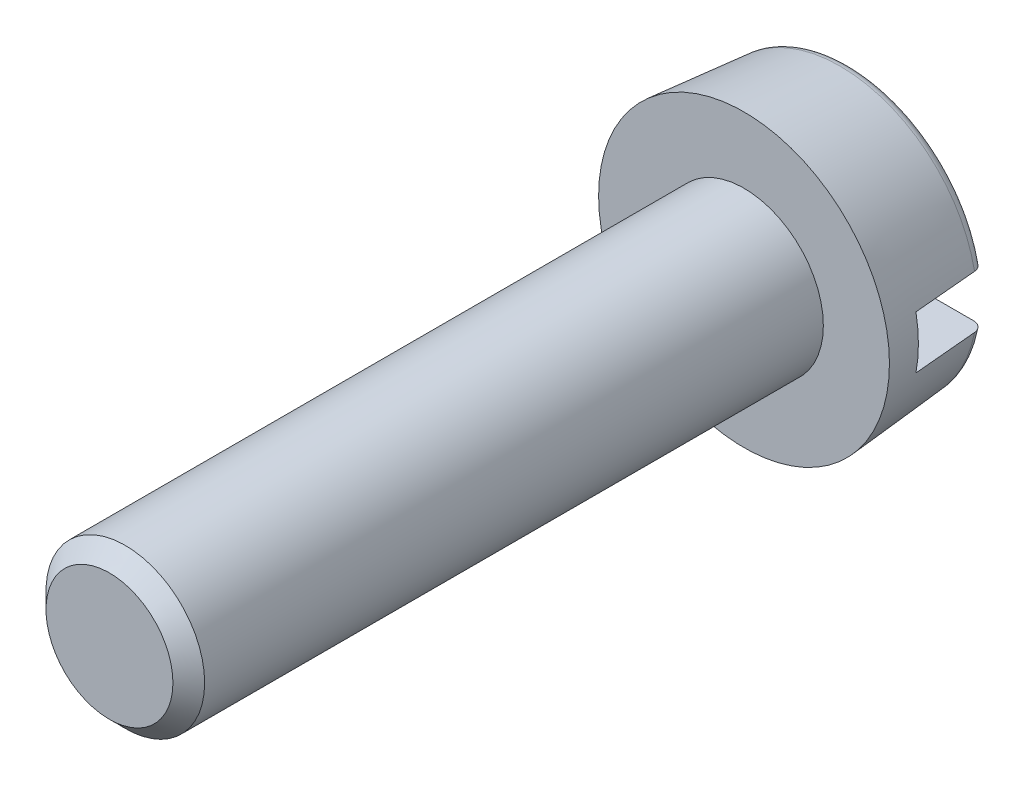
ISO-10303-21;
HEADER;
FILE_DESCRIPTION(('STEP AP214'),'2;1');
FILE_NAME('part.step','',(''),(''),'','','');
FILE_SCHEMA(('AUTOMOTIVE_DESIGN { 1 0 10303 214 1 1 1 1 }'));
ENDSEC;
DATA;
#1=APPLICATION_CONTEXT('core data for automotive mechanical design processes');
#2=APPLICATION_PROTOCOL_DEFINITION('international standard','automotive_design',2000,#1);
#3=PRODUCT_CONTEXT('',#1,'mechanical');
#4=PRODUCT('Part','Part','',(#3));
#5=PRODUCT_RELATED_PRODUCT_CATEGORY('part','',(#4));
#6=PRODUCT_DEFINITION_FORMATION('','',#4);
#7=PRODUCT_DEFINITION_CONTEXT('part definition',#1,'design');
#8=PRODUCT_DEFINITION('design','',#6,#7);
#9=PRODUCT_DEFINITION_SHAPE('','',#8);
#10=(LENGTH_UNIT() NAMED_UNIT(*) SI_UNIT(.MILLI.,.METRE.));
#11=(NAMED_UNIT(*) PLANE_ANGLE_UNIT() SI_UNIT($,.RADIAN.));
#12=(NAMED_UNIT(*) SI_UNIT($,.STERADIAN.) SOLID_ANGLE_UNIT());
#13=UNCERTAINTY_MEASURE_WITH_UNIT(LENGTH_MEASURE(1.E-05),#10,'distance_accuracy_value','');
#14=(GEOMETRIC_REPRESENTATION_CONTEXT(3) GLOBAL_UNCERTAINTY_ASSIGNED_CONTEXT((#13)) GLOBAL_UNIT_ASSIGNED_CONTEXT((#10,
#11,#12)) REPRESENTATION_CONTEXT('',''));
#15=CARTESIAN_POINT('',(0.,0.,0.));
#16=DIRECTION('',(0.,0.,1.));
#17=DIRECTION('',(1.,0.,0.));
#18=AXIS2_PLACEMENT_3D('',#15,#16,#17);
#19=CARTESIAN_POINT('',(0.,0.,-2.));
#20=DIRECTION('',(0.,0.,1.));
#21=DIRECTION('',(1.,0.,0.));
#22=AXIS2_PLACEMENT_3D('',#19,#20,#21);
#23=PLANE('',#22);
#24=DIRECTION('',(1.,0.,0.));
#25=VECTOR('',#24,1.);
#26=CARTESIAN_POINT('',(-2.75,-0.5,-2.));
#27=LINE('',#26,#25);
#28=CARTESIAN_POINT('',(-2.33890975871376,-0.5,-2.));
#29=VERTEX_POINT('',#28);
#30=CARTESIAN_POINT('',(2.33890975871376,-0.5,-2.));
#31=VERTEX_POINT('',#30);
#32=EDGE_CURVE('E197',#29,#31,#27,.T.);
#33=ORIENTED_EDGE('',*,*,#32,.T.);
#34=CARTESIAN_POINT('',(0.,0.,-2.));
#35=DIRECTION('',(0.,0.,-1.));
#36=DIRECTION('',(-1.,0.,0.));
#37=AXIS2_PLACEMENT_3D('',#34,#35,#36);
#38=CIRCLE('',#37,2.39175643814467);
#39=EDGE_CURVE('E107',#31,#29,#38,.T.);
#40=ORIENTED_EDGE('',*,*,#39,.T.);
#41=EDGE_LOOP('',(#33,#40));
#42=FACE_BOUND('',#41,.T.);
#43=ADVANCED_FACE('F27',(#42),#23,.F.);
#44=DIRECTION('',(-1.,0.,0.));
#45=VECTOR('',#44,1.);
#46=CARTESIAN_POINT('',(-2.75,0.5,-2.));
#47=LINE('',#46,#45);
#48=CARTESIAN_POINT('',(2.33890975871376,0.5,-2.));
#49=VERTEX_POINT('',#48);
#50=CARTESIAN_POINT('',(-2.33890975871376,0.5,-2.));
#51=VERTEX_POINT('',#50);
#52=EDGE_CURVE('E92',#49,#51,#47,.T.);
#53=ORIENTED_EDGE('',*,*,#52,.T.);
#54=EDGE_CURVE('E104',#51,#49,#38,.T.);
#55=ORIENTED_EDGE('',*,*,#54,.T.);
#56=EDGE_LOOP('',(#53,#55));
#57=FACE_BOUND('',#56,.T.);
#58=ADVANCED_FACE('F138',(#57),#23,.F.);
#59=CARTESIAN_POINT('',(0.,0.,-1.8));
#60=DIRECTION('',(0.,0.,-1.));
#61=DIRECTION('',(-1.,0.,0.));
#62=AXIS2_PLACEMENT_3D('',#59,#60,#61);
#63=TOROIDAL_SURFACE('',#62,2.39175643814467,0.2);
#64=CARTESIAN_POINT('',(-2.43472133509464,-0.5,-1.62334724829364));
#65=CARTESIAN_POINT('',(-2.44481857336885,-0.5,-1.62858686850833));
#66=CARTESIAN_POINT('',(-2.45447179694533,-0.5,-1.63468201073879));
#67=CARTESIAN_POINT('',(-2.47263104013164,-0.5,-1.64839238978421));
#68=CARTESIAN_POINT('',(-2.48113701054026,-0.5,-1.65600769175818));
#69=CARTESIAN_POINT('',(-2.49674910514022,-0.5,-1.67257485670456));
#70=CARTESIAN_POINT('',(-2.50385388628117,-0.5,-1.68152798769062));
#71=CARTESIAN_POINT('',(-2.51643111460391,-0.5,-1.70051023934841));
#72=CARTESIAN_POINT('',(-2.52190434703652,-0.5,-1.71053883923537));
#73=CARTESIAN_POINT('',(-2.5309838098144,-0.5,-1.73124202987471));
#74=CARTESIAN_POINT('',(-2.53461496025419,-0.5,-1.74190568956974));
#75=CARTESIAN_POINT('',(-2.54000899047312,-0.5,-1.76369811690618));
#76=CARTESIAN_POINT('',(-2.54177157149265,-0.5,-1.77482695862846));
#77=CARTESIAN_POINT('',(-2.54335981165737,-0.5,-1.79707198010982));
#78=CARTESIAN_POINT('',(-2.5432110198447,-0.5,-1.80818634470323));
#79=CARTESIAN_POINT('',(-2.54104324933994,-0.5,-1.83022860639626));
#80=CARTESIAN_POINT('',(-2.53902478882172,-0.5,-1.84115655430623));
#81=CARTESIAN_POINT('',(-2.53333925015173,-0.5,-1.86194423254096));
#82=CARTESIAN_POINT('',(-2.5297662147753,-0.5,-1.87182983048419));
#83=CARTESIAN_POINT('',(-2.52110242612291,-0.5,-1.89091215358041));
#84=CARTESIAN_POINT('',(-2.51601152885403,-0.5,-1.90010881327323));
#85=CARTESIAN_POINT('',(-2.50395114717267,-0.5,-1.91834043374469));
#86=CARTESIAN_POINT('',(-2.49685795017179,-0.5,-1.92729380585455));
#87=CARTESIAN_POINT('',(-2.48126160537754,-0.5,-1.94387567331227));
#88=CARTESIAN_POINT('',(-2.47275808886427,-0.5,-1.95150382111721));
#89=CARTESIAN_POINT('',(-2.45460452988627,-0.5,-1.96522557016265));
#90=CARTESIAN_POINT('',(-2.44495548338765,-0.5,-1.97132049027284));
#91=CARTESIAN_POINT('',(-2.42478363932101,-0.5,-1.98183070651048));
#92=CARTESIAN_POINT('',(-2.41426084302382,-0.5,-1.9862460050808));
#93=CARTESIAN_POINT('',(-2.39247627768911,-0.5,-1.99334317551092));
#94=CARTESIAN_POINT('',(-2.38120597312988,-0.5,-1.99599884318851));
#95=CARTESIAN_POINT('',(-2.35838126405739,-0.5,-1.99941158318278));
#96=CARTESIAN_POINT('',(-2.34682683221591,-0.5,-2.00016847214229));
#97=CARTESIAN_POINT('',(-2.32357645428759,-0.5,-1.9997658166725));
#98=CARTESIAN_POINT('',(-2.31188100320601,-0.5,-1.99857718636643));
#99=CARTESIAN_POINT('',(-2.28885296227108,-0.5,-1.99426077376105));
#100=CARTESIAN_POINT('',(-2.2775203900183,-0.5,-1.99113289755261));
#101=CARTESIAN_POINT('',(-2.25550391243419,-0.5,-1.98300415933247));
#102=CARTESIAN_POINT('',(-2.24482231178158,-0.5,-1.97799704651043));
#103=CARTESIAN_POINT('',(-2.22446468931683,-0.5,-1.96624009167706));
#104=CARTESIAN_POINT('',(-2.21478862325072,-0.5,-1.95949032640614));
#105=CARTESIAN_POINT('',(-2.19684690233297,-0.5,-1.94451734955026));
#106=CARTESIAN_POINT('',(-2.18856586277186,-0.5,-1.93631258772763));
#107=CARTESIAN_POINT('',(-2.17353872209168,-0.5,-1.91860007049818));
#108=CARTESIAN_POINT('',(-2.16679242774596,-0.5,-1.90909247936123));
#109=CARTESIAN_POINT('',(-2.1551967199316,-0.5,-1.88928064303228));
#110=CARTESIAN_POINT('',(-2.15030674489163,-0.5,-1.87900014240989));
#111=CARTESIAN_POINT('',(-2.14236971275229,-0.5,-1.85775104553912));
#112=CARTESIAN_POINT('',(-2.13932233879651,-0.5,-1.84678256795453));
#113=CARTESIAN_POINT('',(-2.13522430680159,-0.5,-1.82474520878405));
#114=CARTESIAN_POINT('',(-2.1341285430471,-0.5,-1.81368469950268));
#115=CARTESIAN_POINT('',(-2.13383163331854,-0.5,-1.79153798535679));
#116=CARTESIAN_POINT('',(-2.1346304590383,-0.5,-1.78045178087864));
#117=CARTESIAN_POINT('',(-2.13807707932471,-0.5,-1.75869214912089));
#118=CARTESIAN_POINT('',(-2.14070518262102,-0.5,-1.74801559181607));
#119=CARTESIAN_POINT('',(-2.14770254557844,-0.5,-1.72725205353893));
#120=CARTESIAN_POINT('',(-2.15207151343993,-0.5,-1.71716497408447));
#121=CARTESIAN_POINT('',(-2.16245261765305,-0.5,-1.69777618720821));
#122=CARTESIAN_POINT('',(-2.16847711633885,-0.5,-1.68848110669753));
#123=CARTESIAN_POINT('',(-2.181972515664,-0.5,-1.6710022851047));
#124=CARTESIAN_POINT('',(-2.189444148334,-0.5,-1.66281911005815));
#125=CARTESIAN_POINT('',(-2.20579015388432,-0.5,-1.64761347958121));
#126=CARTESIAN_POINT('',(-2.21469123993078,-0.5,-1.64061977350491));
#127=CARTESIAN_POINT('',(-2.23351361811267,-0.5,-1.62817840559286));
#128=CARTESIAN_POINT('',(-2.24343476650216,-0.5,-1.62273052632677));
#129=CARTESIAN_POINT('',(-2.25373622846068,-0.5,-1.61813756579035));
#130=B_SPLINE_CURVE_WITH_KNOTS('',3,(#64,#65,#66,#67,#68,#69,#70,#71,#72,#73,#74,#75,#76,#77,
#78,#79,#80,#81,#82,#83,#84,#85,#86,#87,#88,#89,#90,#91,#92,#93,#94,#95,#96,#97,#98,#99,#100,
#101,#102,#103,#104,#105,#106,#107,#108,#109,#110,#111,#112,#113,#114,#115,#116,#117,#118,#119,
#120,#121,#122,#123,#124,#125,#126,#127,#128,#129),.UNSPECIFIED.,.F.,.F.,(4,2,2,2,2,2,2,2,2,2,2,
2,2,2,2,2,2,2,2,2,2,2,2,2,2,2,2,2,2,2,2,2,4),(0.,0.0340885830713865,0.0681786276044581,
0.102301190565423,0.136407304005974,0.170038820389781,0.203675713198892,0.23686345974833,
0.270042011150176,0.301444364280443,0.332849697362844,0.366949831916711,0.40105889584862,
0.435138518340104,0.469218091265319,0.503794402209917,0.538374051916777,0.573475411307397,
0.60857847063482,0.643799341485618,0.679018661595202,0.713819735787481,0.748616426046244,
0.782601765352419,0.816581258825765,0.849764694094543,0.88294763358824,0.91577879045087,
0.948604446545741,0.981682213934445,1.01477675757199,1.04858307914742,1.08238464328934),.UNSPECIFIED.);
#131=CARTESIAN_POINT('',(-2.54229365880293,-0.5,-1.81743114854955));
#132=VERTEX_POINT('',#131);
#133=EDGE_CURVE('E49',#29,#132,#130,.F.);
#134=ORIENTED_EDGE('',*,*,#133,.F.);
#135=ORIENTED_EDGE('',*,*,#39,.F.);
#136=CARTESIAN_POINT('',(2.23155278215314,-0.5,-1.62970236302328));
#137=CARTESIAN_POINT('',(2.2217884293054,-0.5,-1.63555933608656));
#138=CARTESIAN_POINT('',(2.21251766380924,-0.5,-1.64224071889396));
#139=CARTESIAN_POINT('',(2.19521090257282,-0.5,-1.65705158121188));
#140=CARTESIAN_POINT('',(2.18717530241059,-0.5,-1.66518152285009));
#141=CARTESIAN_POINT('',(2.17258522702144,-0.5,-1.68269414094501));
#142=CARTESIAN_POINT('',(2.16603234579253,-0.5,-1.69207814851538));
#143=CARTESIAN_POINT('',(2.15463268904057,-0.5,-1.71182494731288));
#144=CARTESIAN_POINT('',(2.14978492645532,-0.5,-1.72218716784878));
#145=CARTESIAN_POINT('',(2.14202621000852,-0.5,-1.74340062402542));
#146=CARTESIAN_POINT('',(2.13908179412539,-0.5,-1.75423961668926));
#147=CARTESIAN_POINT('',(2.1350912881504,-0.5,-1.77626420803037));
#148=CARTESIAN_POINT('',(2.1340454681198,-0.5,-1.78744985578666));
#149=CARTESIAN_POINT('',(2.13389057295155,-0.5,-1.80963158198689));
#150=CARTESIAN_POINT('',(2.13474687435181,-0.5,-1.82062743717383));
#151=CARTESIAN_POINT('',(2.13829641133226,-0.5,-1.84231561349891));
#152=CARTESIAN_POINT('',(2.14098911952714,-0.5,-1.85300802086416));
#153=CARTESIAN_POINT('',(2.1479196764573,-0.5,-1.87320297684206));
#154=CARTESIAN_POINT('',(2.15206162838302,-0.5,-1.88273861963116));
#155=CARTESIAN_POINT('',(2.16178326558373,-0.5,-1.90104667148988));
#156=CARTESIAN_POINT('',(2.16736315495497,-0.5,-1.90981897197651));
#157=CARTESIAN_POINT('',(2.18048605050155,-0.5,-1.9272950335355));
#158=CARTESIAN_POINT('',(2.18817611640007,-0.5,-1.93588874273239));
#159=CARTESIAN_POINT('',(2.20489721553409,-0.5,-1.95165582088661));
#160=CARTESIAN_POINT('',(2.21392869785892,-0.5,-1.95882871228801));
#161=CARTESIAN_POINT('',(2.2330514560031,-0.5,-1.97156079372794));
#162=CARTESIAN_POINT('',(2.24314168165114,-0.5,-1.97712156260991));
#163=CARTESIAN_POINT('',(2.26410058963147,-0.5,-1.9865003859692));
#164=CARTESIAN_POINT('',(2.27496925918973,-0.5,-1.99031846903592));
#165=CARTESIAN_POINT('',(2.29736007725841,-0.5,-1.99616425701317));
#166=CARTESIAN_POINT('',(2.30888979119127,-0.5,-1.99816300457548));
#167=CARTESIAN_POINT('',(2.33212162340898,-0.5,-2.00021473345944));
#168=CARTESIAN_POINT('',(2.34382375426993,-0.5,-2.0002675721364));
#169=CARTESIAN_POINT('',(2.36717206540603,-0.5,-1.99841415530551));
#170=CARTESIAN_POINT('',(2.37881694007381,-0.5,-1.99649136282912));
#171=CARTESIAN_POINT('',(2.40161490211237,-0.5,-1.99070549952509));
#172=CARTESIAN_POINT('',(2.41276799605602,-0.5,-1.98684245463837));
#173=CARTESIAN_POINT('',(2.43418423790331,-0.5,-1.97730378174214));
#174=CARTESIAN_POINT('',(2.44445268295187,-0.5,-1.97164005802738));
#175=CARTESIAN_POINT('',(2.46387087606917,-0.5,-1.95864065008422));
#176=CARTESIAN_POINT('',(2.47302072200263,-0.5,-1.95130511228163));
#177=CARTESIAN_POINT('',(2.48977261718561,-0.5,-1.93530184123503));
#178=CARTESIAN_POINT('',(2.49739839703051,-0.5,-1.92665895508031));
#179=CARTESIAN_POINT('',(2.51105556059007,-0.5,-1.90819355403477));
#180=CARTESIAN_POINT('',(2.51708711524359,-0.5,-1.89837116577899));
#181=CARTESIAN_POINT('',(2.52726025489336,-0.5,-1.87803442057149));
#182=CARTESIAN_POINT('',(2.53143676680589,-0.5,-1.86753753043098));
#183=CARTESIAN_POINT('',(2.53793838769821,-0.5,-1.84598555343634));
#184=CARTESIAN_POINT('',(2.54026370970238,-0.5,-1.83493053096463));
#185=CARTESIAN_POINT('',(2.54296829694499,-0.5,-1.81275021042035));
#186=CARTESIAN_POINT('',(2.54337563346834,-0.5,-1.80162832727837));
#187=CARTESIAN_POINT('',(2.54230779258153,-0.5,-1.77947486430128));
#188=CARTESIAN_POINT('',(2.54083256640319,-0.5,-1.768443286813));
#189=CARTESIAN_POINT('',(2.53605690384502,-0.5,-1.74683543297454));
#190=CARTESIAN_POINT('',(2.53276473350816,-0.5,-1.73625732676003));
#191=CARTESIAN_POINT('',(2.52446348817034,-0.5,-1.71580054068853));
#192=CARTESIAN_POINT('',(2.51945470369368,-0.5,-1.70592174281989));
#193=CARTESIAN_POINT('',(2.50783233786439,-0.5,-1.68706715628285));
#194=CARTESIAN_POINT('',(2.50120821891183,-0.5,-1.67809786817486));
#195=CARTESIAN_POINT('',(2.48656743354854,-0.5,-1.66137293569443));
#196=CARTESIAN_POINT('',(2.47855014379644,-0.5,-1.65361783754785));
#197=CARTESIAN_POINT('',(2.46121952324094,-0.5,-1.63941570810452));
#198=CARTESIAN_POINT('',(2.45188783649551,-0.5,-1.63299110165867));
#199=CARTESIAN_POINT('',(2.43229769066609,-0.5,-1.62175703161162));
#200=CARTESIAN_POINT('',(2.42203919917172,-0.5,-1.61694762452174));
#201=CARTESIAN_POINT('',(2.41145320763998,-0.5,-1.61302190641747));
#202=B_SPLINE_CURVE_WITH_KNOTS('',3,(#136,#137,#138,#139,#140,#141,#142,#143,#144,#145,#146,
#147,#148,#149,#150,#151,#152,#153,#154,#155,#156,#157,#158,#159,#160,#161,#162,#163,#164,#165,
#166,#167,#168,#169,#170,#171,#172,#173,#174,#175,#176,#177,#178,#179,#180,#181,#182,#183,#184,
#185,#186,#187,#188,#189,#190,#191,#192,#193,#194,#195,#196,#197,#198,#199,#200,#201),
.UNSPECIFIED.,.F.,.F.,(4,2,2,2,2,2,2,2,2,2,2,2,2,2,2,2,2,2,2,2,2,2,2,2,2,2,2,2,2,2,2,2,4),(0.,
0.0341216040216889,0.0682541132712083,0.102423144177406,0.13657236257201,0.170103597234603,
0.203639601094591,0.236570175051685,0.269491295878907,0.30055236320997,0.331617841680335,
0.366043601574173,0.400480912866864,0.434884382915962,0.469287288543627,0.504228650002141,
0.539172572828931,0.574411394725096,0.609649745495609,0.644659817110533,0.679666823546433,
0.71407694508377,0.748483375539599,0.782211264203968,0.815935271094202,0.849164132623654,
0.882393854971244,0.915473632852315,0.948547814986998,0.981843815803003,1.01515475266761,
1.04898816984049,1.08282277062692),.UNSPECIFIED.);
#203=CARTESIAN_POINT('',(2.54229365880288,-0.5,-1.81743114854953));
#204=VERTEX_POINT('',#203);
#205=EDGE_CURVE('E125',#204,#31,#202,.F.);
#206=ORIENTED_EDGE('',*,*,#205,.F.);
#207=CARTESIAN_POINT('',(0.,0.,-1.81743114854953));
#208=DIRECTION('',(0.,0.,-1.));
#209=DIRECTION('',(-1.,0.,0.));
#210=AXIS2_PLACEMENT_3D('',#207,#208,#209);
#211=CIRCLE('',#210,2.59099537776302);
#212=EDGE_CURVE('E116',#204,#132,#211,.T.);
#213=ORIENTED_EDGE('',*,*,#212,.T.);
#214=EDGE_LOOP('',(#134,#135,#206,#213));
#215=FACE_BOUND('',#214,.T.);
#216=ADVANCED_FACE('F133',(#215),#63,.T.);
#217=CARTESIAN_POINT('',(-2.43472133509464,0.5,-1.62334724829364));
#218=CARTESIAN_POINT('',(-2.44481857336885,0.5,-1.62858686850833));
#219=CARTESIAN_POINT('',(-2.45447179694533,0.5,-1.63468201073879));
#220=CARTESIAN_POINT('',(-2.47263104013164,0.5,-1.64839238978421));
#221=CARTESIAN_POINT('',(-2.48113701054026,0.5,-1.65600769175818));
#222=CARTESIAN_POINT('',(-2.49674910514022,0.5,-1.67257485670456));
#223=CARTESIAN_POINT('',(-2.50385388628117,0.5,-1.68152798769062));
#224=CARTESIAN_POINT('',(-2.51643111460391,0.5,-1.70051023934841));
#225=CARTESIAN_POINT('',(-2.52190434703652,0.5,-1.71053883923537));
#226=CARTESIAN_POINT('',(-2.5309838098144,0.5,-1.73124202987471));
#227=CARTESIAN_POINT('',(-2.53461496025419,0.5,-1.74190568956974));
#228=CARTESIAN_POINT('',(-2.54000899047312,0.5,-1.76369811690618));
#229=CARTESIAN_POINT('',(-2.54177157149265,0.5,-1.77482695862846));
#230=CARTESIAN_POINT('',(-2.54335981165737,0.5,-1.79707198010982));
#231=CARTESIAN_POINT('',(-2.5432110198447,0.5,-1.80818634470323));
#232=CARTESIAN_POINT('',(-2.54104324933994,0.5,-1.83022860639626));
#233=CARTESIAN_POINT('',(-2.53902478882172,0.5,-1.84115655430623));
#234=CARTESIAN_POINT('',(-2.53333925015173,0.5,-1.86194423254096));
#235=CARTESIAN_POINT('',(-2.5297662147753,0.5,-1.87182983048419));
#236=CARTESIAN_POINT('',(-2.52110242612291,0.5,-1.89091215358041));
#237=CARTESIAN_POINT('',(-2.51601152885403,0.5,-1.90010881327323));
#238=CARTESIAN_POINT('',(-2.50395114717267,0.5,-1.91834043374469));
#239=CARTESIAN_POINT('',(-2.49685795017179,0.5,-1.92729380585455));
#240=CARTESIAN_POINT('',(-2.48126160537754,0.5,-1.94387567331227));
#241=CARTESIAN_POINT('',(-2.47275808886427,0.5,-1.95150382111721));
#242=CARTESIAN_POINT('',(-2.45460452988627,0.5,-1.96522557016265));
#243=CARTESIAN_POINT('',(-2.44495548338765,0.5,-1.97132049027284));
#244=CARTESIAN_POINT('',(-2.42478363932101,0.5,-1.98183070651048));
#245=CARTESIAN_POINT('',(-2.41426084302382,0.5,-1.9862460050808));
#246=CARTESIAN_POINT('',(-2.39247627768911,0.5,-1.99334317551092));
#247=CARTESIAN_POINT('',(-2.38120597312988,0.5,-1.99599884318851));
#248=CARTESIAN_POINT('',(-2.35838126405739,0.5,-1.99941158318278));
#249=CARTESIAN_POINT('',(-2.34682683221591,0.5,-2.00016847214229));
#250=CARTESIAN_POINT('',(-2.32357645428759,0.5,-1.9997658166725));
#251=CARTESIAN_POINT('',(-2.31188100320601,0.5,-1.99857718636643));
#252=CARTESIAN_POINT('',(-2.28885296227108,0.5,-1.99426077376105));
#253=CARTESIAN_POINT('',(-2.2775203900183,0.5,-1.99113289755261));
#254=CARTESIAN_POINT('',(-2.25550391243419,0.5,-1.98300415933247));
#255=CARTESIAN_POINT('',(-2.24482231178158,0.5,-1.97799704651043));
#256=CARTESIAN_POINT('',(-2.22446468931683,0.5,-1.96624009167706));
#257=CARTESIAN_POINT('',(-2.21478862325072,0.5,-1.95949032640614));
#258=CARTESIAN_POINT('',(-2.19684690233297,0.5,-1.94451734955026));
#259=CARTESIAN_POINT('',(-2.18856586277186,0.5,-1.93631258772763));
#260=CARTESIAN_POINT('',(-2.17353872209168,0.5,-1.91860007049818));
#261=CARTESIAN_POINT('',(-2.16679242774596,0.5,-1.90909247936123));
#262=CARTESIAN_POINT('',(-2.1551967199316,0.5,-1.88928064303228));
#263=CARTESIAN_POINT('',(-2.15030674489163,0.5,-1.87900014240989));
#264=CARTESIAN_POINT('',(-2.14236971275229,0.5,-1.85775104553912));
#265=CARTESIAN_POINT('',(-2.13932233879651,0.5,-1.84678256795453));
#266=CARTESIAN_POINT('',(-2.13522430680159,0.5,-1.82474520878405));
#267=CARTESIAN_POINT('',(-2.1341285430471,0.5,-1.81368469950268));
#268=CARTESIAN_POINT('',(-2.13383163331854,0.5,-1.79153798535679));
#269=CARTESIAN_POINT('',(-2.1346304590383,0.5,-1.78045178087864));
#270=CARTESIAN_POINT('',(-2.13807707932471,0.5,-1.75869214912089));
#271=CARTESIAN_POINT('',(-2.14070518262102,0.5,-1.74801559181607));
#272=CARTESIAN_POINT('',(-2.14770254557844,0.5,-1.72725205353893));
#273=CARTESIAN_POINT('',(-2.15207151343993,0.5,-1.71716497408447));
#274=CARTESIAN_POINT('',(-2.16245261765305,0.5,-1.69777618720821));
#275=CARTESIAN_POINT('',(-2.16847711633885,0.5,-1.68848110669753));
#276=CARTESIAN_POINT('',(-2.181972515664,0.5,-1.6710022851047));
#277=CARTESIAN_POINT('',(-2.189444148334,0.5,-1.66281911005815));
#278=CARTESIAN_POINT('',(-2.20579015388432,0.5,-1.64761347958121));
#279=CARTESIAN_POINT('',(-2.21469123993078,0.5,-1.64061977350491));
#280=CARTESIAN_POINT('',(-2.23351361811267,0.5,-1.62817840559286));
#281=CARTESIAN_POINT('',(-2.24343476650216,0.5,-1.62273052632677));
#282=CARTESIAN_POINT('',(-2.25373622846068,0.5,-1.61813756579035));
#283=B_SPLINE_CURVE_WITH_KNOTS('',3,(#217,#218,#219,#220,#221,#222,#223,#224,#225,#226,#227,
#228,#229,#230,#231,#232,#233,#234,#235,#236,#237,#238,#239,#240,#241,#242,#243,#244,#245,#246,
#247,#248,#249,#250,#251,#252,#253,#254,#255,#256,#257,#258,#259,#260,#261,#262,#263,#264,#265,
#266,#267,#268,#269,#270,#271,#272,#273,#274,#275,#276,#277,#278,#279,#280,#281,#282),
.UNSPECIFIED.,.F.,.F.,(4,2,2,2,2,2,2,2,2,2,2,2,2,2,2,2,2,2,2,2,2,2,2,2,2,2,2,2,2,2,2,2,4),(0.,
0.0340885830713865,0.0681786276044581,0.102301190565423,0.136407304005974,0.170038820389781,
0.203675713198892,0.23686345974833,0.270042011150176,0.301444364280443,0.332849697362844,
0.366949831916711,0.40105889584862,0.435138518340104,0.469218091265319,0.503794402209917,
0.538374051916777,0.573475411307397,0.60857847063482,0.643799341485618,0.679018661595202,
0.713819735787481,0.748616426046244,0.782601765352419,0.816581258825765,0.849764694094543,
0.88294763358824,0.91577879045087,0.948604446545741,0.981682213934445,1.01477675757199,
1.04858307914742,1.08238464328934),.UNSPECIFIED.);
#284=CARTESIAN_POINT('',(-2.54229365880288,0.5,-1.81743114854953));
#285=VERTEX_POINT('',#284);
#286=EDGE_CURVE('E150',#285,#51,#283,.T.);
#287=ORIENTED_EDGE('',*,*,#286,.F.);
#288=CARTESIAN_POINT('',(2.54229365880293,0.5,-1.81743114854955));
#289=VERTEX_POINT('',#288);
#290=EDGE_CURVE('E112',#285,#289,#211,.T.);
#291=ORIENTED_EDGE('',*,*,#290,.T.);
#292=CARTESIAN_POINT('',(2.23155278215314,0.5,-1.62970236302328));
#293=CARTESIAN_POINT('',(2.2217884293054,0.5,-1.63555933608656));
#294=CARTESIAN_POINT('',(2.21251766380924,0.5,-1.64224071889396));
#295=CARTESIAN_POINT('',(2.19521090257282,0.5,-1.65705158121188));
#296=CARTESIAN_POINT('',(2.18717530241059,0.5,-1.66518152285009));
#297=CARTESIAN_POINT('',(2.17258522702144,0.5,-1.68269414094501));
#298=CARTESIAN_POINT('',(2.16603234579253,0.5,-1.69207814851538));
#299=CARTESIAN_POINT('',(2.15463268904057,0.5,-1.71182494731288));
#300=CARTESIAN_POINT('',(2.14978492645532,0.5,-1.72218716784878));
#301=CARTESIAN_POINT('',(2.14202621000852,0.5,-1.74340062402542));
#302=CARTESIAN_POINT('',(2.13908179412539,0.5,-1.75423961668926));
#303=CARTESIAN_POINT('',(2.1350912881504,0.5,-1.77626420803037));
#304=CARTESIAN_POINT('',(2.1340454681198,0.5,-1.78744985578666));
#305=CARTESIAN_POINT('',(2.13389057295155,0.5,-1.80963158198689));
#306=CARTESIAN_POINT('',(2.13474687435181,0.5,-1.82062743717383));
#307=CARTESIAN_POINT('',(2.13829641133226,0.5,-1.84231561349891));
#308=CARTESIAN_POINT('',(2.14098911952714,0.5,-1.85300802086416));
#309=CARTESIAN_POINT('',(2.1479196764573,0.5,-1.87320297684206));
#310=CARTESIAN_POINT('',(2.15206162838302,0.5,-1.88273861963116));
#311=CARTESIAN_POINT('',(2.16178326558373,0.5,-1.90104667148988));
#312=CARTESIAN_POINT('',(2.16736315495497,0.5,-1.90981897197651));
#313=CARTESIAN_POINT('',(2.18048605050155,0.5,-1.9272950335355));
#314=CARTESIAN_POINT('',(2.18817611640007,0.5,-1.93588874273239));
#315=CARTESIAN_POINT('',(2.20489721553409,0.5,-1.95165582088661));
#316=CARTESIAN_POINT('',(2.21392869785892,0.5,-1.95882871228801));
#317=CARTESIAN_POINT('',(2.2330514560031,0.5,-1.97156079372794));
#318=CARTESIAN_POINT('',(2.24314168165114,0.5,-1.97712156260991));
#319=CARTESIAN_POINT('',(2.26410058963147,0.5,-1.9865003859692));
#320=CARTESIAN_POINT('',(2.27496925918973,0.5,-1.99031846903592));
#321=CARTESIAN_POINT('',(2.29736007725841,0.5,-1.99616425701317));
#322=CARTESIAN_POINT('',(2.30888979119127,0.5,-1.99816300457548));
#323=CARTESIAN_POINT('',(2.33212162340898,0.5,-2.00021473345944));
#324=CARTESIAN_POINT('',(2.34382375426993,0.5,-2.0002675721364));
#325=CARTESIAN_POINT('',(2.36717206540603,0.5,-1.99841415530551));
#326=CARTESIAN_POINT('',(2.37881694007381,0.5,-1.99649136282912));
#327=CARTESIAN_POINT('',(2.40161490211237,0.5,-1.99070549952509));
#328=CARTESIAN_POINT('',(2.41276799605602,0.5,-1.98684245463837));
#329=CARTESIAN_POINT('',(2.43418423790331,0.5,-1.97730378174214));
#330=CARTESIAN_POINT('',(2.44445268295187,0.5,-1.97164005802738));
#331=CARTESIAN_POINT('',(2.46387087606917,0.5,-1.95864065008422));
#332=CARTESIAN_POINT('',(2.47302072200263,0.5,-1.95130511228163));
#333=CARTESIAN_POINT('',(2.48977261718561,0.5,-1.93530184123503));
#334=CARTESIAN_POINT('',(2.49739839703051,0.5,-1.92665895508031));
#335=CARTESIAN_POINT('',(2.51105556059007,0.5,-1.90819355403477));
#336=CARTESIAN_POINT('',(2.51708711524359,0.5,-1.89837116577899));
#337=CARTESIAN_POINT('',(2.52726025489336,0.5,-1.87803442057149));
#338=CARTESIAN_POINT('',(2.53143676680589,0.5,-1.86753753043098));
#339=CARTESIAN_POINT('',(2.53793838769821,0.5,-1.84598555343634));
#340=CARTESIAN_POINT('',(2.54026370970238,0.5,-1.83493053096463));
#341=CARTESIAN_POINT('',(2.54296829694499,0.5,-1.81275021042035));
#342=CARTESIAN_POINT('',(2.54337563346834,0.5,-1.80162832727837));
#343=CARTESIAN_POINT('',(2.54230779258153,0.5,-1.77947486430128));
#344=CARTESIAN_POINT('',(2.54083256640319,0.5,-1.768443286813));
#345=CARTESIAN_POINT('',(2.53605690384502,0.5,-1.74683543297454));
#346=CARTESIAN_POINT('',(2.53276473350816,0.5,-1.73625732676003));
#347=CARTESIAN_POINT('',(2.52446348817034,0.5,-1.71580054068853));
#348=CARTESIAN_POINT('',(2.51945470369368,0.5,-1.70592174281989));
#349=CARTESIAN_POINT('',(2.50783233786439,0.5,-1.68706715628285));
#350=CARTESIAN_POINT('',(2.50120821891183,0.5,-1.67809786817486));
#351=CARTESIAN_POINT('',(2.48656743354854,0.5,-1.66137293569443));
#352=CARTESIAN_POINT('',(2.47855014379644,0.5,-1.65361783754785));
#353=CARTESIAN_POINT('',(2.46121952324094,0.5,-1.63941570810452));
#354=CARTESIAN_POINT('',(2.45188783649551,0.5,-1.63299110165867));
#355=CARTESIAN_POINT('',(2.43229769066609,0.5,-1.62175703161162));
#356=CARTESIAN_POINT('',(2.42203919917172,0.5,-1.61694762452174));
#357=CARTESIAN_POINT('',(2.41145320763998,0.5,-1.61302190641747));
#358=B_SPLINE_CURVE_WITH_KNOTS('',3,(#292,#293,#294,#295,#296,#297,#298,#299,#300,#301,#302,
#303,#304,#305,#306,#307,#308,#309,#310,#311,#312,#313,#314,#315,#316,#317,#318,#319,#320,#321,
#322,#323,#324,#325,#326,#327,#328,#329,#330,#331,#332,#333,#334,#335,#336,#337,#338,#339,#340,
#341,#342,#343,#344,#345,#346,#347,#348,#349,#350,#351,#352,#353,#354,#355,#356,#357),
.UNSPECIFIED.,.F.,.F.,(4,2,2,2,2,2,2,2,2,2,2,2,2,2,2,2,2,2,2,2,2,2,2,2,2,2,2,2,2,2,2,2,4),(0.,
0.0341216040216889,0.0682541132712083,0.102423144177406,0.13657236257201,0.170103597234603,
0.203639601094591,0.236570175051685,0.269491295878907,0.30055236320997,0.331617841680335,
0.366043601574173,0.400480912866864,0.434884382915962,0.469287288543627,0.504228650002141,
0.539172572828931,0.574411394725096,0.609649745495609,0.644659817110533,0.679666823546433,
0.71407694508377,0.748483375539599,0.782211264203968,0.815935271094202,0.849164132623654,
0.882393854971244,0.915473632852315,0.948547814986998,0.981843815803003,1.01515475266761,
1.04898816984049,1.08282277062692),.UNSPECIFIED.);
#359=EDGE_CURVE('E144',#49,#289,#358,.T.);
#360=ORIENTED_EDGE('',*,*,#359,.F.);
#361=ORIENTED_EDGE('',*,*,#54,.F.);
#362=EDGE_LOOP('',(#287,#291,#360,#361));
#363=FACE_BOUND('',#362,.T.);
#364=ADVANCED_FACE('F137',(#363),#63,.T.);
#365=CARTESIAN_POINT('',(0.,0.,0.));
#366=DIRECTION('',(0.,0.,1.));
#367=DIRECTION('',(1.,0.,0.));
#368=AXIS2_PLACEMENT_3D('',#365,#366,#367);
#369=CONICAL_SURFACE('',#368,2.75,0.0872664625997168);
#370=CARTESIAN_POINT('',(0.,0.,0.));
#371=DIRECTION('',(0.,0.,-1.));
#372=DIRECTION('',(-1.,0.,0.));
#373=AXIS2_PLACEMENT_3D('',#370,#371,#372);
#374=CIRCLE('',#373,2.75);
#375=CARTESIAN_POINT('',(-2.75,0.,0.));
#376=VERTEX_POINT('',#375);
#377=EDGE_CURVE('E117',#376,#376,#374,.T.);
#378=ORIENTED_EDGE('',*,*,#377,.T.);
#379=EDGE_LOOP('',(#378));
#380=FACE_BOUND('',#379,.T.);
#381=CARTESIAN_POINT('',(-2.15972648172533,-0.5,-6.09394642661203));
#382=CARTESIAN_POINT('',(-2.28129523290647,-0.5,-4.73997484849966));
#383=CARTESIAN_POINT('',(-2.40239758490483,-0.5,-3.38596154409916));
#384=CARTESIAN_POINT('',(-2.54622291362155,-0.5,-1.77341036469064));
#385=CARTESIAN_POINT('',(-2.56926739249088,-0.5,-1.51490117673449));
#386=CARTESIAN_POINT('',(-2.73597999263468,-0.5,0.356173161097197));
#387=CARTESIAN_POINT('',(-2.87922206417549,-0.5,1.96877629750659));
#388=CARTESIAN_POINT('',(-3.02225104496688,-0.5,3.58139823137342));
#389=B_SPLINE_CURVE_WITH_KNOTS('',3,(#381,#382,#383,#384,#385,#386,#387,#388),.UNSPECIFIED.,.F.,
.F.,(4,2,2,4),(0.,4.07825448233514,4.8568573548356,9.71371455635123),.UNSPECIFIED.);
#390=CARTESIAN_POINT('',(-2.65076271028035,-0.5,-0.6));
#391=VERTEX_POINT('',#390);
#392=EDGE_CURVE('E77',#132,#391,#389,.T.);
#393=ORIENTED_EDGE('',*,*,#392,.F.);
#394=ORIENTED_EDGE('',*,*,#212,.F.);
#395=CARTESIAN_POINT('',(3.02225104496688,-0.5,3.58139823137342));
#396=CARTESIAN_POINT('',(2.95074726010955,-0.5,2.77508626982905));
#397=CARTESIAN_POINT('',(2.87917986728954,-0.5,1.96877994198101));
#398=CARTESIAN_POINT('',(2.73587676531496,-0.5,0.356182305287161));
#399=CARTESIAN_POINT('',(2.66414105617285,-0.5,-0.450109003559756));
#400=CARTESIAN_POINT('',(2.52046020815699,-0.5,-2.06267299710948));
#401=CARTESIAN_POINT('',(2.4485150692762,-0.5,-2.86894568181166));
#402=CARTESIAN_POINT('',(2.30434660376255,-0.5,-4.48146623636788));
#403=CARTESIAN_POINT('',(2.23212327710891,-0.5,-5.28771410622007));
#404=CARTESIAN_POINT('',(2.15972648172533,-0.5,-6.09394642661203));
#405=B_SPLINE_CURVE_WITH_KNOTS('',3,(#395,#396,#397,#398,#399,#400,#401,#402,#403,#404),
.UNSPECIFIED.,.F.,.F.,(4,2,2,2,4),(0.,2.42842870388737,4.85685722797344,7.28528583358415,
9.71371462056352),.UNSPECIFIED.);
#406=CARTESIAN_POINT('',(2.65076271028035,-0.5,-0.6));
#407=VERTEX_POINT('',#406);
#408=EDGE_CURVE('E97',#407,#204,#405,.T.);
#409=ORIENTED_EDGE('',*,*,#408,.F.);
#410=CARTESIAN_POINT('',(0.,0.,-0.6));
#411=DIRECTION('',(0.,0.,1.));
#412=DIRECTION('',(1.,0.,0.));
#413=AXIS2_PLACEMENT_3D('',#410,#411,#412);
#414=CIRCLE('',#413,2.69750680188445);
#415=CARTESIAN_POINT('',(2.65076271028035,0.5,-0.6));
#416=VERTEX_POINT('',#415);
#417=EDGE_CURVE('E91',#407,#416,#414,.T.);
#418=ORIENTED_EDGE('',*,*,#417,.T.);
#419=CARTESIAN_POINT('',(2.15972648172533,0.5,-6.09394642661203));
#420=CARTESIAN_POINT('',(2.28129523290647,0.5,-4.73997484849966));
#421=CARTESIAN_POINT('',(2.40239758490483,0.5,-3.38596154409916));
#422=CARTESIAN_POINT('',(2.54622291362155,0.5,-1.77341036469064));
#423=CARTESIAN_POINT('',(2.56926739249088,0.5,-1.51490117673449));
#424=CARTESIAN_POINT('',(2.73597999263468,0.5,0.356173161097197));
#425=CARTESIAN_POINT('',(2.87922206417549,0.5,1.96877629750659));
#426=CARTESIAN_POINT('',(3.02225104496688,0.5,3.58139823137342));
#427=B_SPLINE_CURVE_WITH_KNOTS('',3,(#419,#420,#421,#422,#423,#424,#425,#426),.UNSPECIFIED.,.F.,
.F.,(4,2,2,4),(0.,4.07825448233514,4.8568573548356,9.71371455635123),.UNSPECIFIED.);
#428=EDGE_CURVE('E100',#289,#416,#427,.T.);
#429=ORIENTED_EDGE('',*,*,#428,.F.);
#430=ORIENTED_EDGE('',*,*,#290,.F.);
#431=CARTESIAN_POINT('',(-3.02225104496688,0.5,3.58139823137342));
#432=CARTESIAN_POINT('',(-2.95074726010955,0.5,2.77508626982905));
#433=CARTESIAN_POINT('',(-2.87917986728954,0.5,1.96877994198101));
#434=CARTESIAN_POINT('',(-2.73587676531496,0.5,0.356182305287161));
#435=CARTESIAN_POINT('',(-2.66414105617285,0.5,-0.450109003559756));
#436=CARTESIAN_POINT('',(-2.52046020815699,0.5,-2.06267299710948));
#437=CARTESIAN_POINT('',(-2.4485150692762,0.5,-2.86894568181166));
#438=CARTESIAN_POINT('',(-2.30434660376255,0.5,-4.48146623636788));
#439=CARTESIAN_POINT('',(-2.23212327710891,0.5,-5.28771410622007));
#440=CARTESIAN_POINT('',(-2.15972648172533,0.5,-6.09394642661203));
#441=B_SPLINE_CURVE_WITH_KNOTS('',3,(#431,#432,#433,#434,#435,#436,#437,#438,#439,#440),
.UNSPECIFIED.,.F.,.F.,(4,2,2,2,4),(0.,2.42842870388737,4.85685722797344,7.28528583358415,
9.71371462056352),.UNSPECIFIED.);
#442=CARTESIAN_POINT('',(-2.65076271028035,0.5,-0.6));
#443=VERTEX_POINT('',#442);
#444=EDGE_CURVE('E86',#443,#285,#441,.T.);
#445=ORIENTED_EDGE('',*,*,#444,.F.);
#446=EDGE_CURVE('E89',#443,#391,#414,.T.);
#447=ORIENTED_EDGE('',*,*,#446,.T.);
#448=EDGE_LOOP('',(#393,#394,#409,#418,#429,#430,#445,#447));
#449=FACE_BOUND('',#448,.T.);
#450=ADVANCED_FACE('F95',(#380,#449),#369,.T.);
#451=CARTESIAN_POINT('',(0.,0.,0.));
#452=DIRECTION('',(0.,0.,-1.));
#453=DIRECTION('',(-1.,0.,0.));
#454=AXIS2_PLACEMENT_3D('',#451,#452,#453);
#455=PLANE('',#454);
#456=CARTESIAN_POINT('',(0.,0.,0.));
#457=DIRECTION('',(0.,0.,1.));
#458=DIRECTION('',(1.,0.,0.));
#459=AXIS2_PLACEMENT_3D('',#456,#457,#458);
#460=CIRCLE('',#459,1.5);
#461=CARTESIAN_POINT('',(1.5,0.,0.));
#462=VERTEX_POINT('',#461);
#463=EDGE_CURVE('E199',#462,#462,#460,.T.);
#464=ORIENTED_EDGE('',*,*,#463,.F.);
#465=EDGE_LOOP('',(#464));
#466=FACE_BOUND('',#465,.T.);
#467=ORIENTED_EDGE('',*,*,#377,.F.);
#468=EDGE_LOOP('',(#467));
#469=FACE_BOUND('',#468,.T.);
#470=ADVANCED_FACE('F212',(#466,#469),#455,.F.);
#471=CARTESIAN_POINT('',(-2.75,-0.5,-0.6));
#472=DIRECTION('',(0.,1.,0.));
#473=DIRECTION('',(0.,0.,1.));
#474=AXIS2_PLACEMENT_3D('',#471,#472,#473);
#475=PLANE('',#474);
#476=ORIENTED_EDGE('',*,*,#133,.T.);
#477=ORIENTED_EDGE('',*,*,#392,.T.);
#478=DIRECTION('',(1.,0.,0.));
#479=VECTOR('',#478,1.);
#480=CARTESIAN_POINT('',(-2.75,-0.5,-0.6));
#481=LINE('',#480,#479);
#482=EDGE_CURVE('E80',#391,#407,#481,.T.);
#483=ORIENTED_EDGE('',*,*,#482,.T.);
#484=ORIENTED_EDGE('',*,*,#408,.T.);
#485=ORIENTED_EDGE('',*,*,#205,.T.);
#486=ORIENTED_EDGE('',*,*,#32,.F.);
#487=EDGE_LOOP('',(#476,#477,#483,#484,#485,#486));
#488=FACE_BOUND('',#487,.T.);
#489=ADVANCED_FACE('F79',(#488),#475,.T.);
#490=CARTESIAN_POINT('',(-2.75,0.5,-0.6));
#491=DIRECTION('',(0.,-1.,0.));
#492=DIRECTION('',(0.,0.,-1.));
#493=AXIS2_PLACEMENT_3D('',#490,#491,#492);
#494=PLANE('',#493);
#495=ORIENTED_EDGE('',*,*,#286,.T.);
#496=ORIENTED_EDGE('',*,*,#52,.F.);
#497=ORIENTED_EDGE('',*,*,#359,.T.);
#498=ORIENTED_EDGE('',*,*,#428,.T.);
#499=DIRECTION('',(-1.,0.,0.));
#500=VECTOR('',#499,1.);
#501=CARTESIAN_POINT('',(-2.75,0.5,-0.6));
#502=LINE('',#501,#500);
#503=EDGE_CURVE('E41',#416,#443,#502,.T.);
#504=ORIENTED_EDGE('',*,*,#503,.T.);
#505=ORIENTED_EDGE('',*,*,#444,.T.);
#506=EDGE_LOOP('',(#495,#496,#497,#498,#504,#505));
#507=FACE_BOUND('',#506,.T.);
#508=ADVANCED_FACE('F154',(#507),#494,.T.);
#509=CARTESIAN_POINT('',(-2.75,-0.5,-0.6));
#510=DIRECTION('',(0.,0.,1.));
#511=DIRECTION('',(1.,0.,0.));
#512=AXIS2_PLACEMENT_3D('',#509,#510,#511);
#513=PLANE('',#512);
#514=ORIENTED_EDGE('',*,*,#503,.F.);
#515=ORIENTED_EDGE('',*,*,#417,.F.);
#516=ORIENTED_EDGE('',*,*,#482,.F.);
#517=ORIENTED_EDGE('',*,*,#446,.F.);
#518=EDGE_LOOP('',(#514,#515,#516,#517));
#519=FACE_BOUND('',#518,.T.);
#520=ADVANCED_FACE('F88',(#519),#513,.F.);
#521=CARTESIAN_POINT('',(0.,0.,12.));
#522=DIRECTION('',(0.,0.,1.));
#523=DIRECTION('',(1.,0.,0.));
#524=AXIS2_PLACEMENT_3D('',#521,#522,#523);
#525=PLANE('',#524);
#526=CARTESIAN_POINT('',(0.,0.,12.));
#527=DIRECTION('',(0.,0.,1.));
#528=DIRECTION('',(1.,0.,0.));
#529=AXIS2_PLACEMENT_3D('',#526,#527,#528);
#530=CIRCLE('',#529,1.19999999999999);
#531=CARTESIAN_POINT('',(1.2,0.,12.));
#532=VERTEX_POINT('',#531);
#533=EDGE_CURVE('E34',#532,#532,#530,.T.);
#534=ORIENTED_EDGE('',*,*,#533,.T.);
#535=EDGE_LOOP('',(#534));
#536=FACE_BOUND('',#535,.T.);
#537=ADVANCED_FACE('F178',(#536),#525,.T.);
#538=CARTESIAN_POINT('',(0.,0.,0.));
#539=DIRECTION('',(0.,0.,1.));
#540=DIRECTION('',(1.,0.,0.));
#541=AXIS2_PLACEMENT_3D('',#538,#539,#540);
#542=CYLINDRICAL_SURFACE('',#541,1.5);
#543=CARTESIAN_POINT('',(0.,0.,11.7));
#544=DIRECTION('',(0.,0.,1.));
#545=DIRECTION('',(1.,0.,0.));
#546=AXIS2_PLACEMENT_3D('',#543,#544,#545);
#547=CIRCLE('',#546,1.5);
#548=CARTESIAN_POINT('',(1.5,0.,11.7));
#549=VERTEX_POINT('',#548);
#550=EDGE_CURVE('E11',#549,#549,#547,.F.);
#551=ORIENTED_EDGE('',*,*,#550,.T.);
#552=EDGE_LOOP('',(#551));
#553=FACE_BOUND('',#552,.T.);
#554=ORIENTED_EDGE('',*,*,#463,.T.);
#555=EDGE_LOOP('',(#554));
#556=FACE_BOUND('',#555,.T.);
#557=ADVANCED_FACE('F182',(#553,#556),#542,.T.);
#558=CARTESIAN_POINT('',(0.,0.,12.));
#559=DIRECTION('',(0.,0.,-1.));
#560=DIRECTION('',(-1.,0.,0.));
#561=AXIS2_PLACEMENT_3D('',#558,#559,#560);
#562=CONICAL_SURFACE('',#561,1.19999999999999,0.785398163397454);
#563=ORIENTED_EDGE('',*,*,#550,.F.);
#564=EDGE_LOOP('',(#563));
#565=FACE_BOUND('',#564,.T.);
#566=ORIENTED_EDGE('',*,*,#533,.F.);
#567=EDGE_LOOP('',(#566));
#568=FACE_BOUND('',#567,.T.);
#569=ADVANCED_FACE('F180',(#565,#568),#562,.T.);
#570=CLOSED_SHELL('',(#43,#58,#216,#364,#450,#470,#489,#508,#520,#537,#557,#569));
#571=MANIFOLD_SOLID_BREP('B2',#570);
#572=ADVANCED_BREP_SHAPE_REPRESENTATION('',(#18,#571),#14);
#573=SHAPE_DEFINITION_REPRESENTATION(#9,#572);
ENDSEC;
END-ISO-10303-21;
